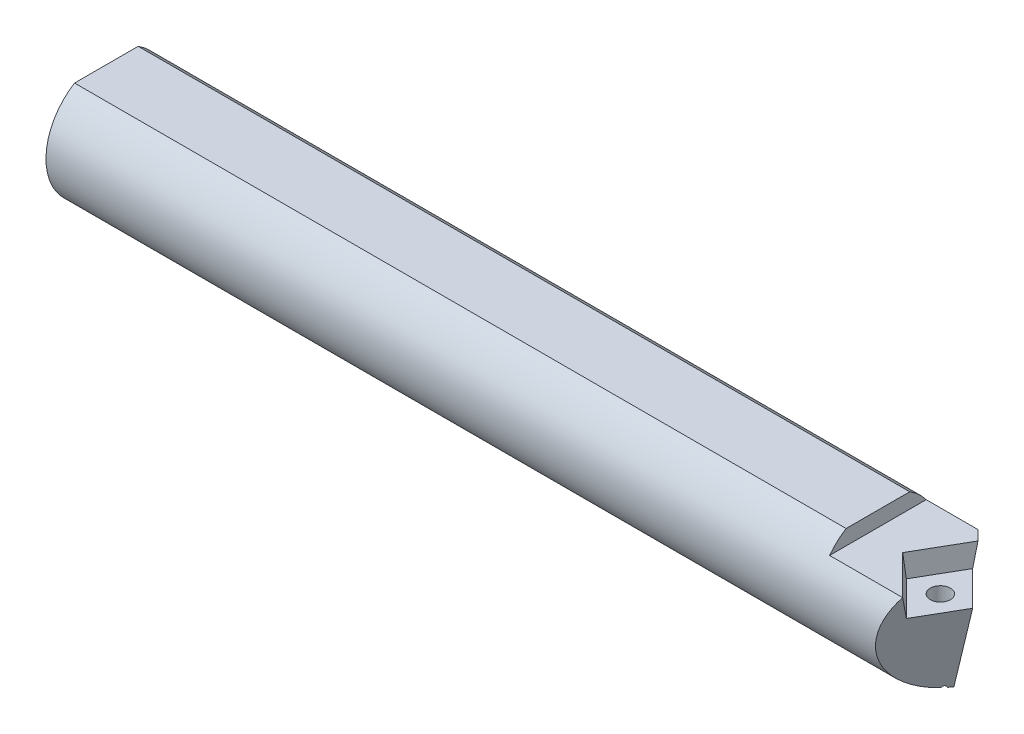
from build123d import *

# Parameters (mm, degrees)
SKETCH1_R           = 9
BOSS_EXTRUDE1_DEPTH = 65
SKETCH2_W           = 130
SKETCH2_H           = 18
CUT_EXTRUDE1_DEPTH  = 68.69950147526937
CUT_EXTRUDE2_DEPTH  = 15
CUT_EXTRUDE3_DEPTH  = 3.18
CUT_EXTRUDE3_DRAFT  = -7.000000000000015
SKETCH5_R           = 1.500000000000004
CUT_EXTRUDE4_DEPTH  = 67.57242972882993
CUT_EXTRUDE5_DEPTH  = 68.1815452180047
CUT_EXTRUDE5_TAPER  = -10.000000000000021


with BuildPart() as part:
    # Sketch1 → Boss-Extrude1 (new, symmetric)
    with BuildSketch(Plane(origin=(0, 0, 0), x_dir=(0, 0, -1), z_dir=(1, 0, 0))):
        Circle(SKETCH1_R)
    extrude(amount=BOSS_EXTRUDE1_DEPTH, both=True)

    # Sketch2 → Cut-Extrude1 (cut, through all)
    with BuildSketch(Plane(origin=(0, 7.65, 0), x_dir=(1, 0, 0), z_dir=(0, 1, 0))):
        Rectangle(SKETCH2_W, SKETCH2_H)
    extrude(amount=CUT_EXTRUDE1_DEPTH, mode=Mode.SUBTRACT)

    # Sketch3 → Cut-Extrude2 (cut)
    with BuildSketch(Plane(origin=(65, 0, 0), x_dir=(0, 0, -1), z_dir=(1, 0, 0))):
        Polygon((-10.366720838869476, 5.4), (10.723125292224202, 5.4), (10.723125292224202, 7.6499999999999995), (-10.366720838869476, 7.65), align=None)
    extrude(amount=-CUT_EXTRUDE2_DEPTH, mode=Mode.SUBTRACT)


with BuildPart() as cut_extrude3_tool:
    # Sketch4 → Cut-Extrude3 (with draft: the straight prism first)
    with BuildSketch(Plane(origin=(0, 5.4, 0), x_dir=(1, 0, 0), z_dir=(0, 1, 0))):
        Polygon((65, -0.08119075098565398), (59.18751658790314, 5.731292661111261), (55.0774701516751, -1.3875165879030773), (60.889953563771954, -7.200000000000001), align=None)
    extrude(amount=-CUT_EXTRUDE3_DEPTH)
    # Cut-Extrude3: the draft: its side faces are tilted about the plane it starts from
    cut_extrude3_sides = [cut_extrude3_tool.faces().sort_by_distance(p)[0] for p in [
        (62.093758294, 3.81, -2.825050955),
        (57.13249337, 3.81, -2.171888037),
        (57.983711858, 3.81, 4.293758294),
        (62.944976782, 3.81, 3.640595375),
    ]]
    draft(cut_extrude3_sides, Plane(origin=(0, 5.4, 0), x_dir=(1, 0, 0), z_dir=(0, 1, 0)), CUT_EXTRUDE3_DRAFT)


with BuildPart() as part_1:
    add(part.part)

    # Cut-Extrude3: cut by cut_extrude3_tool
    add(cut_extrude3_tool.part, mode=Mode.SUBTRACT)

    # Sketch5 → Cut-Extrude4 (cut, through all)
    with BuildSketch(Plane(origin=(0, 2.22, 0), x_dir=(1, 0, 0), z_dir=(0, 1, 0))):
        with Locations(Location((60.03873507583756, -0.7343536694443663, 0), (0, 0, 270))):
            Circle(SKETCH5_R)
    extrude(amount=-CUT_EXTRUDE4_DEPTH, mode=Mode.SUBTRACT)

    # Sketch6 → Cut-Extrude5 (cut, through all)
    with BuildSketch(Plane(origin=(0, 5.4, 0), x_dir=(1, 0, 0), z_dir=(0, 1, 0))):
        Polygon((70.81248341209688, -5.893674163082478), (65.00000000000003, -0.08119075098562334), (60.889953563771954, -7.200000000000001), (53.76470194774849, -19.541297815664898), (70.8124834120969, -19.54129781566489), align=None)
        Polygon((65, 7.199999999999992), (65, -0.08119075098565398), (70.81248341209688, -5.893674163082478), (70.81248341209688, 16.11296123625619), (48.805848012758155, 16.112961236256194), (57.7188092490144, 7.199999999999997), align=None)
        Polygon((57.7188092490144, 7.199999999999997), (59.18751658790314, 5.731292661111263), (65.00000000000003, -0.08119075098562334), (65, 7.199999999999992), align=None)
    extrude(amount=-CUT_EXTRUDE5_DEPTH, taper=CUT_EXTRUDE5_TAPER, mode=Mode.SUBTRACT)


solid = part_1.part
